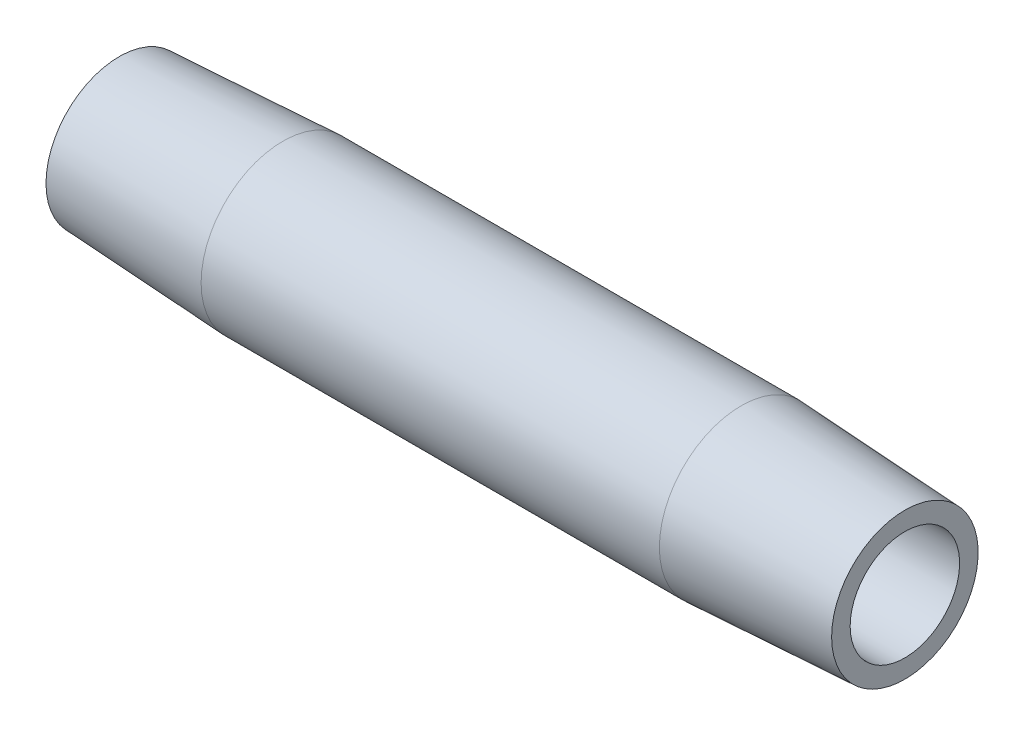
from build123d import *


with BuildPart() as part:
    # Sketch2 → Revolve1 (revolve)
    with BuildSketch(Plane.XY, mode=Mode.PRIVATE) as revolve1_sk:
        Polygon((7.9375, 3.96875), (0, 3.552763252), (0, 2.6543), (38.1, 2.6543), (38.1, 3.552763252), (30.1625, 3.96875), align=None)
    revolve(revolve1_sk.sketch.rotate(Axis((0.476141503, 0, 0), (1, 0, 0)), 90), axis=Axis((0.476141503, 0, 0), (1, 0, 0)))


solid = part.part
